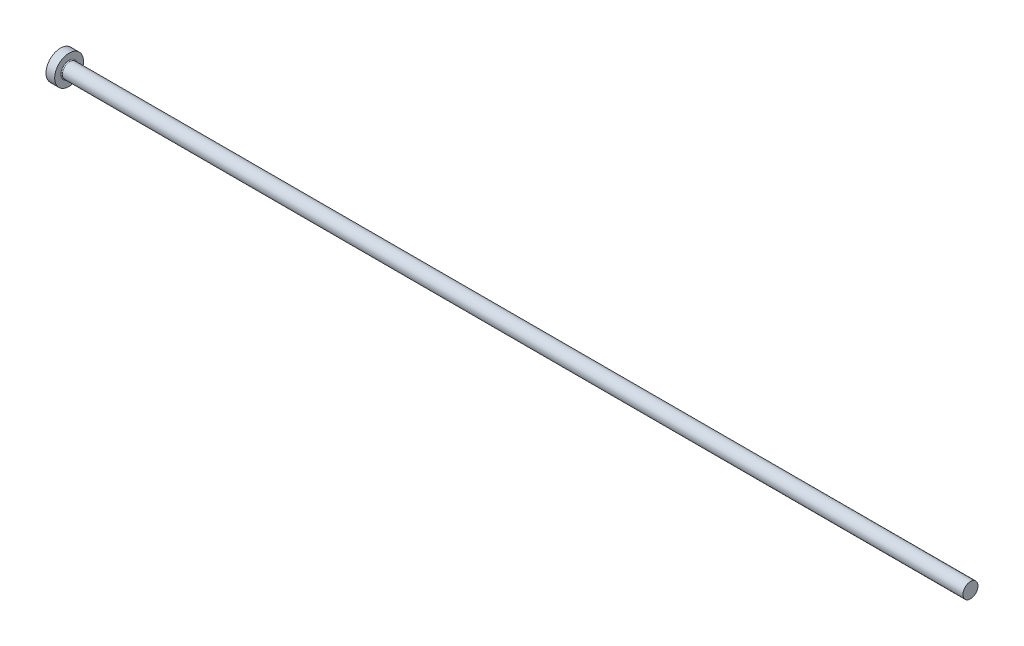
ISO-10303-21;
HEADER;
FILE_DESCRIPTION(('STEP AP214'),'2;1');
FILE_NAME('part.step','',(''),(''),'','','');
FILE_SCHEMA(('AUTOMOTIVE_DESIGN { 1 0 10303 214 1 1 1 1 }'));
ENDSEC;
DATA;
#1=APPLICATION_CONTEXT('core data for automotive mechanical design processes');
#2=APPLICATION_PROTOCOL_DEFINITION('international standard','automotive_design',2000,#1);
#3=PRODUCT_CONTEXT('',#1,'mechanical');
#4=PRODUCT('Part','Part','',(#3));
#5=PRODUCT_RELATED_PRODUCT_CATEGORY('part','',(#4));
#6=PRODUCT_DEFINITION_FORMATION('','',#4);
#7=PRODUCT_DEFINITION_CONTEXT('part definition',#1,'design');
#8=PRODUCT_DEFINITION('design','',#6,#7);
#9=PRODUCT_DEFINITION_SHAPE('','',#8);
#10=(LENGTH_UNIT() NAMED_UNIT(*) SI_UNIT(.MILLI.,.METRE.));
#11=(NAMED_UNIT(*) PLANE_ANGLE_UNIT() SI_UNIT($,.RADIAN.));
#12=(NAMED_UNIT(*) SI_UNIT($,.STERADIAN.) SOLID_ANGLE_UNIT());
#13=UNCERTAINTY_MEASURE_WITH_UNIT(LENGTH_MEASURE(1.E-05),#10,'distance_accuracy_value','');
#14=(GEOMETRIC_REPRESENTATION_CONTEXT(3) GLOBAL_UNCERTAINTY_ASSIGNED_CONTEXT((#13)) GLOBAL_UNIT_ASSIGNED_CONTEXT((#10,
#11,#12)) REPRESENTATION_CONTEXT('',''));
#15=CARTESIAN_POINT('',(0.,0.,0.));
#16=DIRECTION('',(0.,0.,1.));
#17=DIRECTION('',(1.,0.,0.));
#18=AXIS2_PLACEMENT_3D('',#15,#16,#17);
#19=CARTESIAN_POINT('',(0.,0.,0.));
#20=DIRECTION('',(-1.,0.,0.));
#21=DIRECTION('',(0.,-1.,0.));
#22=AXIS2_PLACEMENT_3D('',#19,#20,#21);
#23=PLANE('',#22);
#24=CARTESIAN_POINT('',(0.,0.,0.));
#25=DIRECTION('',(1.,0.,0.));
#26=DIRECTION('',(0.,1.,0.));
#27=AXIS2_PLACEMENT_3D('',#24,#25,#26);
#28=CIRCLE('',#27,5.);
#29=CARTESIAN_POINT('',(0.,5.,0.));
#30=VERTEX_POINT('',#29);
#31=EDGE_CURVE('E25',#30,#30,#28,.T.);
#32=ORIENTED_EDGE('',*,*,#31,.F.);
#33=EDGE_LOOP('',(#32));
#34=FACE_BOUND('',#33,.T.);
#35=ADVANCED_FACE('F14',(#34),#23,.T.);
#36=CARTESIAN_POINT('',(315.,0.,0.));
#37=DIRECTION('',(1.,0.,0.));
#38=DIRECTION('',(0.,1.,0.));
#39=AXIS2_PLACEMENT_3D('',#36,#37,#38);
#40=CYLINDRICAL_SURFACE('',#39,5.);
#41=ORIENTED_EDGE('',*,*,#31,.T.);
#42=EDGE_LOOP('',(#41));
#43=FACE_BOUND('',#42,.T.);
#44=CARTESIAN_POINT('',(3.,0.,0.));
#45=DIRECTION('',(1.,0.,0.));
#46=DIRECTION('',(0.,1.,0.));
#47=AXIS2_PLACEMENT_3D('',#44,#45,#46);
#48=CIRCLE('',#47,5.);
#49=CARTESIAN_POINT('',(3.,5.,0.));
#50=VERTEX_POINT('',#49);
#51=EDGE_CURVE('E29',#50,#50,#48,.T.);
#52=ORIENTED_EDGE('',*,*,#51,.F.);
#53=EDGE_LOOP('',(#52));
#54=FACE_BOUND('',#53,.T.);
#55=ADVANCED_FACE('F51',(#43,#54),#40,.T.);
#56=CARTESIAN_POINT('',(3.,5.,0.));
#57=DIRECTION('',(1.,0.,0.));
#58=DIRECTION('',(0.,1.,0.));
#59=AXIS2_PLACEMENT_3D('',#56,#57,#58);
#60=PLANE('',#59);
#61=CARTESIAN_POINT('',(3.,0.,0.));
#62=DIRECTION('',(1.,0.,0.));
#63=DIRECTION('',(0.,1.,0.));
#64=AXIS2_PLACEMENT_3D('',#61,#62,#63);
#65=CIRCLE('',#64,2.89999999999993);
#66=CARTESIAN_POINT('',(3.,2.89999999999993,0.));
#67=VERTEX_POINT('',#66);
#68=EDGE_CURVE('E9',#67,#67,#65,.F.);
#69=ORIENTED_EDGE('',*,*,#68,.T.);
#70=EDGE_LOOP('',(#69));
#71=FACE_BOUND('',#70,.T.);
#72=ORIENTED_EDGE('',*,*,#51,.T.);
#73=EDGE_LOOP('',(#72));
#74=FACE_BOUND('',#73,.T.);
#75=ADVANCED_FACE('F42',(#71,#74),#60,.T.);
#76=CARTESIAN_POINT('',(315.,0.,0.));
#77=DIRECTION('',(1.,0.,0.));
#78=DIRECTION('',(0.,1.,0.));
#79=AXIS2_PLACEMENT_3D('',#76,#77,#78);
#80=CYLINDRICAL_SURFACE('',#79,2.59999999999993);
#81=CARTESIAN_POINT('',(3.3,0.,0.));
#82=DIRECTION('',(1.,0.,0.));
#83=DIRECTION('',(0.,1.,0.));
#84=AXIS2_PLACEMENT_3D('',#81,#82,#83);
#85=CIRCLE('',#84,2.59999999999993);
#86=CARTESIAN_POINT('',(3.3,2.59999999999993,0.));
#87=VERTEX_POINT('',#86);
#88=EDGE_CURVE('E21',#87,#87,#85,.T.);
#89=ORIENTED_EDGE('',*,*,#88,.T.);
#90=EDGE_LOOP('',(#89));
#91=FACE_BOUND('',#90,.T.);
#92=CARTESIAN_POINT('',(315.,0.,0.));
#93=DIRECTION('',(1.,0.,0.));
#94=DIRECTION('',(0.,1.,0.));
#95=AXIS2_PLACEMENT_3D('',#92,#93,#94);
#96=CIRCLE('',#95,2.59999999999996);
#97=CARTESIAN_POINT('',(315.,2.59999999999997,0.));
#98=VERTEX_POINT('',#97);
#99=EDGE_CURVE('E34',#98,#98,#96,.T.);
#100=ORIENTED_EDGE('',*,*,#99,.F.);
#101=EDGE_LOOP('',(#100));
#102=FACE_BOUND('',#101,.T.);
#103=ADVANCED_FACE('F40',(#91,#102),#80,.T.);
#104=CARTESIAN_POINT('',(315.,2.6,0.));
#105=DIRECTION('',(1.,0.,0.));
#106=DIRECTION('',(0.,1.,0.));
#107=AXIS2_PLACEMENT_3D('',#104,#105,#106);
#108=PLANE('',#107);
#109=ORIENTED_EDGE('',*,*,#99,.T.);
#110=EDGE_LOOP('',(#109));
#111=FACE_BOUND('',#110,.T.);
#112=ADVANCED_FACE('F38',(#111),#108,.T.);
#113=CARTESIAN_POINT('',(3.3,0.,0.));
#114=DIRECTION('',(1.,0.,0.));
#115=DIRECTION('',(0.,1.,0.));
#116=AXIS2_PLACEMENT_3D('',#113,#114,#115);
#117=TOROIDAL_SURFACE('',#116,2.89999999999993,0.3);
#118=ORIENTED_EDGE('',*,*,#68,.F.);
#119=EDGE_LOOP('',(#118));
#120=FACE_BOUND('',#119,.T.);
#121=ORIENTED_EDGE('',*,*,#88,.F.);
#122=EDGE_LOOP('',(#121));
#123=FACE_BOUND('',#122,.T.);
#124=ADVANCED_FACE('F16',(#120,#123),#117,.F.);
#125=CLOSED_SHELL('',(#35,#55,#75,#103,#112,#124));
#126=MANIFOLD_SOLID_BREP('B1',#125);
#127=ADVANCED_BREP_SHAPE_REPRESENTATION('',(#18,#126),#14);
#128=SHAPE_DEFINITION_REPRESENTATION(#9,#127);
ENDSEC;
END-ISO-10303-21;
